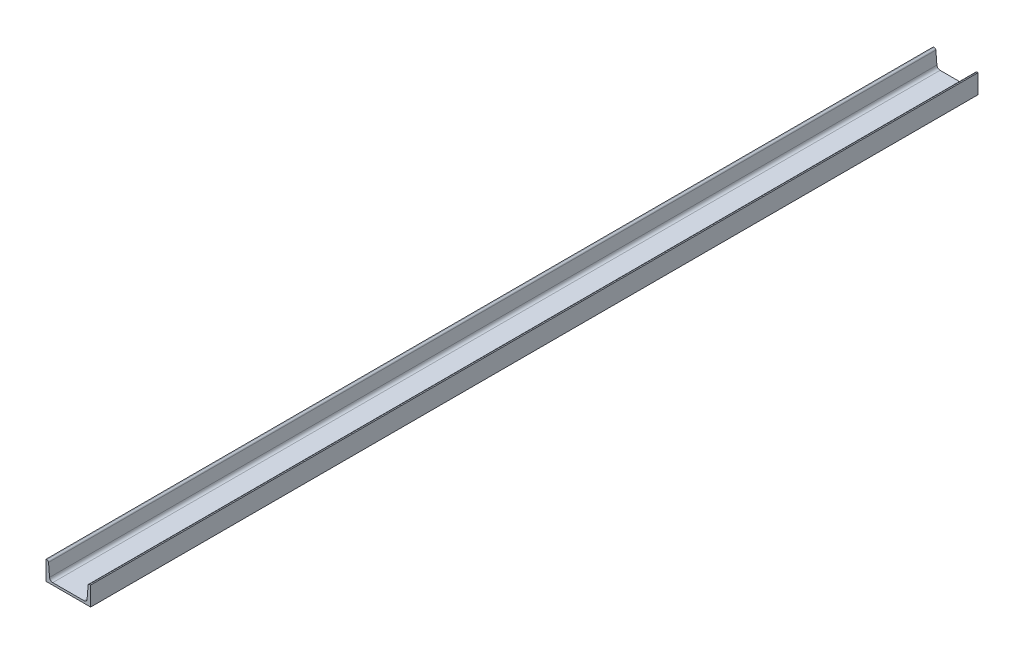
ISO-10303-21;
HEADER;
FILE_DESCRIPTION(('STEP AP214'),'2;1');
FILE_NAME('part.step','',(''),(''),'','','');
FILE_SCHEMA(('AUTOMOTIVE_DESIGN { 1 0 10303 214 1 1 1 1 }'));
ENDSEC;
DATA;
#1=APPLICATION_CONTEXT('core data for automotive mechanical design processes');
#2=APPLICATION_PROTOCOL_DEFINITION('international standard','automotive_design',2000,#1);
#3=PRODUCT_CONTEXT('',#1,'mechanical');
#4=PRODUCT('Part','Part','',(#3));
#5=PRODUCT_RELATED_PRODUCT_CATEGORY('part','',(#4));
#6=PRODUCT_DEFINITION_FORMATION('','',#4);
#7=PRODUCT_DEFINITION_CONTEXT('part definition',#1,'design');
#8=PRODUCT_DEFINITION('design','',#6,#7);
#9=PRODUCT_DEFINITION_SHAPE('','',#8);
#10=(LENGTH_UNIT() NAMED_UNIT(*) SI_UNIT(.MILLI.,.METRE.));
#11=(NAMED_UNIT(*) PLANE_ANGLE_UNIT() SI_UNIT($,.RADIAN.));
#12=(NAMED_UNIT(*) SI_UNIT($,.STERADIAN.) SOLID_ANGLE_UNIT());
#13=UNCERTAINTY_MEASURE_WITH_UNIT(LENGTH_MEASURE(1.E-05),#10,'distance_accuracy_value','');
#14=(GEOMETRIC_REPRESENTATION_CONTEXT(3) GLOBAL_UNCERTAINTY_ASSIGNED_CONTEXT((#13)) GLOBAL_UNIT_ASSIGNED_CONTEXT((#10,
#11,#12)) REPRESENTATION_CONTEXT('',''));
#15=CARTESIAN_POINT('',(0.,0.,0.));
#16=DIRECTION('',(0.,0.,1.));
#17=DIRECTION('',(1.,0.,0.));
#18=AXIS2_PLACEMENT_3D('',#15,#16,#17);
#19=CARTESIAN_POINT('',(48.9280510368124,17.,1391.5));
#20=DIRECTION('',(0.,0.,-1.));
#21=DIRECTION('',(-1.,0.,0.));
#22=AXIS2_PLACEMENT_3D('',#19,#20,#21);
#23=CYLINDRICAL_SURFACE('',#22,10.);
#24=CARTESIAN_POINT('',(48.9280510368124,17.,-1391.5));
#25=DIRECTION('',(0.,0.,1.));
#26=DIRECTION('',(1.,0.,0.));
#27=AXIS2_PLACEMENT_3D('',#24,#25,#26);
#28=CIRCLE('',#27,10.);
#29=CARTESIAN_POINT('',(48.9280510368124,7.,-1391.5));
#30=VERTEX_POINT('',#29);
#31=CARTESIAN_POINT('',(58.8962038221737,16.202547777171,-1391.5));
#32=VERTEX_POINT('',#31);
#33=EDGE_CURVE('E103',#30,#32,#28,.T.);
#34=ORIENTED_EDGE('',*,*,#33,.F.);
#35=DIRECTION('',(0.,0.,-1.));
#36=VECTOR('',#35,1.);
#37=CARTESIAN_POINT('',(48.9280510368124,7.,1391.5));
#38=LINE('',#37,#36);
#39=CARTESIAN_POINT('',(48.9280510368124,7.,1391.5));
#40=VERTEX_POINT('',#39);
#41=EDGE_CURVE('E9',#40,#30,#38,.T.);
#42=ORIENTED_EDGE('',*,*,#41,.F.);
#43=CARTESIAN_POINT('',(48.9280510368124,17.,1391.5));
#44=DIRECTION('',(0.,0.,1.));
#45=DIRECTION('',(1.,0.,0.));
#46=AXIS2_PLACEMENT_3D('',#43,#44,#45);
#47=CIRCLE('',#46,10.);
#48=CARTESIAN_POINT('',(58.8962038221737,16.202547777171,1391.5));
#49=VERTEX_POINT('',#48);
#50=EDGE_CURVE('E105',#40,#49,#47,.T.);
#51=ORIENTED_EDGE('',*,*,#50,.T.);
#52=DIRECTION('',(0.,0.,-1.));
#53=VECTOR('',#52,1.);
#54=CARTESIAN_POINT('',(58.8962038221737,16.202547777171,1391.5));
#55=LINE('',#54,#53);
#56=EDGE_CURVE('E17',#49,#32,#55,.T.);
#57=ORIENTED_EDGE('',*,*,#56,.T.);
#58=EDGE_LOOP('',(#34,#42,#51,#57));
#59=FACE_BOUND('',#58,.T.);
#60=ADVANCED_FACE('F14',(#59),#23,.F.);
#61=CARTESIAN_POINT('',(-48.9280510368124,7.,1391.5));
#62=DIRECTION('',(0.,1.,0.));
#63=DIRECTION('',(0.,0.,1.));
#64=AXIS2_PLACEMENT_3D('',#61,#62,#63);
#65=PLANE('',#64);
#66=DIRECTION('',(1.,0.,0.));
#67=VECTOR('',#66,1.);
#68=CARTESIAN_POINT('',(-48.9280510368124,7.,-1391.5));
#69=LINE('',#68,#67);
#70=CARTESIAN_POINT('',(-48.9280510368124,7.,-1391.5));
#71=VERTEX_POINT('',#70);
#72=EDGE_CURVE('E124',#71,#30,#69,.T.);
#73=ORIENTED_EDGE('',*,*,#72,.F.);
#74=DIRECTION('',(0.,0.,-1.));
#75=VECTOR('',#74,1.);
#76=CARTESIAN_POINT('',(-48.9280510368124,7.,1391.5));
#77=LINE('',#76,#75);
#78=CARTESIAN_POINT('',(-48.9280510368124,7.,1391.5));
#79=VERTEX_POINT('',#78);
#80=EDGE_CURVE('E23',#79,#71,#77,.T.);
#81=ORIENTED_EDGE('',*,*,#80,.F.);
#82=DIRECTION('',(1.,0.,0.));
#83=VECTOR('',#82,1.);
#84=CARTESIAN_POINT('',(-48.9280510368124,7.,1391.5));
#85=LINE('',#84,#83);
#86=EDGE_CURVE('E111',#79,#40,#85,.T.);
#87=ORIENTED_EDGE('',*,*,#86,.T.);
#88=ORIENTED_EDGE('',*,*,#41,.T.);
#89=EDGE_LOOP('',(#73,#81,#87,#88));
#90=FACE_BOUND('',#89,.T.);
#91=ADVANCED_FACE('F315',(#90),#65,.T.);
#92=CARTESIAN_POINT('',(-48.9280510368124,17.,1391.5));
#93=DIRECTION('',(0.,0.,-1.));
#94=DIRECTION('',(-1.,0.,0.));
#95=AXIS2_PLACEMENT_3D('',#92,#93,#94);
#96=CYLINDRICAL_SURFACE('',#95,10.);
#97=CARTESIAN_POINT('',(-48.9280510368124,17.,-1391.5));
#98=DIRECTION('',(0.,0.,1.));
#99=DIRECTION('',(1.,0.,0.));
#100=AXIS2_PLACEMENT_3D('',#97,#98,#99);
#101=CIRCLE('',#100,10.);
#102=CARTESIAN_POINT('',(-58.8962038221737,16.2025477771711,-1391.5));
#103=VERTEX_POINT('',#102);
#104=EDGE_CURVE('E337',#103,#71,#101,.T.);
#105=ORIENTED_EDGE('',*,*,#104,.F.);
#106=DIRECTION('',(0.,0.,-1.));
#107=VECTOR('',#106,1.);
#108=CARTESIAN_POINT('',(-58.8962038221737,16.2025477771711,1391.5));
#109=LINE('',#108,#107);
#110=CARTESIAN_POINT('',(-58.8962038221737,16.2025477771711,1391.5));
#111=VERTEX_POINT('',#110);
#112=EDGE_CURVE('E170',#111,#103,#109,.T.);
#113=ORIENTED_EDGE('',*,*,#112,.F.);
#114=CARTESIAN_POINT('',(-48.9280510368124,17.,1391.5));
#115=DIRECTION('',(0.,0.,1.));
#116=DIRECTION('',(1.,0.,0.));
#117=AXIS2_PLACEMENT_3D('',#114,#115,#116);
#118=CIRCLE('',#117,10.);
#119=EDGE_CURVE('E161',#111,#79,#118,.T.);
#120=ORIENTED_EDGE('',*,*,#119,.T.);
#121=ORIENTED_EDGE('',*,*,#80,.T.);
#122=EDGE_LOOP('',(#105,#113,#120,#121));
#123=FACE_BOUND('',#122,.T.);
#124=ADVANCED_FACE('F306',(#123),#96,.F.);
#125=CARTESIAN_POINT('',(-58.8962038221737,16.2025477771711,1391.5));
#126=DIRECTION('',(-0.996815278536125,-0.07974522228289,0.));
#127=DIRECTION('',(0.07974522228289,-0.996815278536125,0.));
#128=AXIS2_PLACEMENT_3D('',#125,#126,#127);
#129=PLANE('',#128);
#130=DIRECTION('',(-0.07974522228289,0.996815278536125,0.));
#131=VECTOR('',#130,1.);
#132=CARTESIAN_POINT('',(-58.8962038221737,16.2025477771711,-1391.5));
#133=LINE('',#132,#131);
#134=CARTESIAN_POINT('',(-62.0318980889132,55.3987261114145,-1391.5));
#135=VERTEX_POINT('',#134);
#136=EDGE_CURVE('E343',#103,#135,#133,.T.);
#137=ORIENTED_EDGE('',*,*,#136,.T.);
#138=DIRECTION('',(0.,0.,-1.));
#139=VECTOR('',#138,1.);
#140=CARTESIAN_POINT('',(-62.0318980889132,55.3987261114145,1391.5));
#141=LINE('',#140,#139);
#142=CARTESIAN_POINT('',(-62.0318980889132,55.3987261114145,1391.5));
#143=VERTEX_POINT('',#142);
#144=EDGE_CURVE('E173',#143,#135,#141,.T.);
#145=ORIENTED_EDGE('',*,*,#144,.F.);
#146=DIRECTION('',(-0.07974522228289,0.996815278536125,0.));
#147=VECTOR('',#146,1.);
#148=CARTESIAN_POINT('',(-58.8962038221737,16.2025477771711,1391.5));
#149=LINE('',#148,#147);
#150=EDGE_CURVE('E158',#111,#143,#149,.T.);
#151=ORIENTED_EDGE('',*,*,#150,.F.);
#152=ORIENTED_EDGE('',*,*,#112,.T.);
#153=EDGE_LOOP('',(#137,#145,#151,#152));
#154=FACE_BOUND('',#153,.T.);
#155=ADVANCED_FACE('F297',(#154),#129,.F.);
#156=CARTESIAN_POINT('',(-67.0159744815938,55.,1391.5));
#157=DIRECTION('',(0.,0.,-1.));
#158=DIRECTION('',(-1.,0.,0.));
#159=AXIS2_PLACEMENT_3D('',#156,#157,#158);
#160=CYLINDRICAL_SURFACE('',#159,5.);
#161=CARTESIAN_POINT('',(-67.0159744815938,55.,-1391.5));
#162=DIRECTION('',(0.,0.,1.));
#163=DIRECTION('',(1.,0.,0.));
#164=AXIS2_PLACEMENT_3D('',#161,#162,#163);
#165=CIRCLE('',#164,5.);
#166=CARTESIAN_POINT('',(-67.0159744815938,60.,-1391.5));
#167=VERTEX_POINT('',#166);
#168=EDGE_CURVE('E349',#135,#167,#165,.T.);
#169=ORIENTED_EDGE('',*,*,#168,.T.);
#170=DIRECTION('',(0.,0.,-1.));
#171=VECTOR('',#170,1.);
#172=CARTESIAN_POINT('',(-67.0159744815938,60.,1391.5));
#173=LINE('',#172,#171);
#174=CARTESIAN_POINT('',(-67.0159744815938,60.,1391.5));
#175=VERTEX_POINT('',#174);
#176=EDGE_CURVE('E177',#175,#167,#173,.T.);
#177=ORIENTED_EDGE('',*,*,#176,.F.);
#178=CARTESIAN_POINT('',(-67.0159744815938,55.,1391.5));
#179=DIRECTION('',(0.,0.,1.));
#180=DIRECTION('',(1.,0.,0.));
#181=AXIS2_PLACEMENT_3D('',#178,#179,#180);
#182=CIRCLE('',#181,5.);
#183=EDGE_CURVE('E155',#143,#175,#182,.T.);
#184=ORIENTED_EDGE('',*,*,#183,.F.);
#185=ORIENTED_EDGE('',*,*,#144,.T.);
#186=EDGE_LOOP('',(#169,#177,#184,#185));
#187=FACE_BOUND('',#186,.T.);
#188=ADVANCED_FACE('F288',(#187),#160,.T.);
#189=CARTESIAN_POINT('',(-70.,60.,1391.5));
#190=DIRECTION('',(0.,1.,0.));
#191=DIRECTION('',(0.,0.,1.));
#192=AXIS2_PLACEMENT_3D('',#189,#190,#191);
#193=PLANE('',#192);
#194=DIRECTION('',(1.,0.,0.));
#195=VECTOR('',#194,1.);
#196=CARTESIAN_POINT('',(-70.,60.,-1391.5));
#197=LINE('',#196,#195);
#198=CARTESIAN_POINT('',(-70.,60.,-1391.5));
#199=VERTEX_POINT('',#198);
#200=EDGE_CURVE('E357',#199,#167,#197,.T.);
#201=ORIENTED_EDGE('',*,*,#200,.F.);
#202=DIRECTION('',(0.,0.,-1.));
#203=VECTOR('',#202,1.);
#204=CARTESIAN_POINT('',(-70.,60.,1391.5));
#205=LINE('',#204,#203);
#206=CARTESIAN_POINT('',(-70.,60.,1391.5));
#207=VERTEX_POINT('',#206);
#208=EDGE_CURVE('E180',#207,#199,#205,.T.);
#209=ORIENTED_EDGE('',*,*,#208,.F.);
#210=DIRECTION('',(1.,0.,0.));
#211=VECTOR('',#210,1.);
#212=CARTESIAN_POINT('',(-70.,60.,1391.5));
#213=LINE('',#212,#211);
#214=EDGE_CURVE('E151',#207,#175,#213,.T.);
#215=ORIENTED_EDGE('',*,*,#214,.T.);
#216=ORIENTED_EDGE('',*,*,#176,.T.);
#217=EDGE_LOOP('',(#201,#209,#215,#216));
#218=FACE_BOUND('',#217,.T.);
#219=ADVANCED_FACE('F279',(#218),#193,.T.);
#220=CARTESIAN_POINT('',(-70.,60.,1391.5));
#221=DIRECTION('',(1.,0.,0.));
#222=DIRECTION('',(0.,0.,-1.));
#223=AXIS2_PLACEMENT_3D('',#220,#221,#222);
#224=PLANE('',#223);
#225=DIRECTION('',(0.,-1.,0.));
#226=VECTOR('',#225,1.);
#227=CARTESIAN_POINT('',(-70.,60.,-1391.5));
#228=LINE('',#227,#226);
#229=CARTESIAN_POINT('',(-70.,0.,-1391.5));
#230=VERTEX_POINT('',#229);
#231=EDGE_CURVE('E365',#199,#230,#228,.T.);
#232=ORIENTED_EDGE('',*,*,#231,.T.);
#233=DIRECTION('',(0.,0.,-1.));
#234=VECTOR('',#233,1.);
#235=CARTESIAN_POINT('',(-70.,0.,1391.5));
#236=LINE('',#235,#234);
#237=CARTESIAN_POINT('',(-70.,0.,1391.5));
#238=VERTEX_POINT('',#237);
#239=EDGE_CURVE('E183',#238,#230,#236,.T.);
#240=ORIENTED_EDGE('',*,*,#239,.F.);
#241=DIRECTION('',(0.,-1.,0.));
#242=VECTOR('',#241,1.);
#243=CARTESIAN_POINT('',(-70.,60.,1391.5));
#244=LINE('',#243,#242);
#245=EDGE_CURVE('E148',#207,#238,#244,.T.);
#246=ORIENTED_EDGE('',*,*,#245,.F.);
#247=ORIENTED_EDGE('',*,*,#208,.T.);
#248=EDGE_LOOP('',(#232,#240,#246,#247));
#249=FACE_BOUND('',#248,.T.);
#250=ADVANCED_FACE('F270',(#249),#224,.F.);
#251=CARTESIAN_POINT('',(-70.,0.,1391.5));
#252=DIRECTION('',(0.,1.,0.));
#253=DIRECTION('',(0.,0.,1.));
#254=AXIS2_PLACEMENT_3D('',#251,#252,#253);
#255=PLANE('',#254);
#256=DIRECTION('',(1.,0.,0.));
#257=VECTOR('',#256,1.);
#258=CARTESIAN_POINT('',(-70.,0.,-1391.5));
#259=LINE('',#258,#257);
#260=CARTESIAN_POINT('',(70.,0.,-1391.5));
#261=VERTEX_POINT('',#260);
#262=EDGE_CURVE('E372',#230,#261,#259,.T.);
#263=ORIENTED_EDGE('',*,*,#262,.T.);
#264=DIRECTION('',(0.,0.,-1.));
#265=VECTOR('',#264,1.);
#266=CARTESIAN_POINT('',(70.,0.,1391.5));
#267=LINE('',#266,#265);
#268=CARTESIAN_POINT('',(70.,0.,1391.5));
#269=VERTEX_POINT('',#268);
#270=EDGE_CURVE('E187',#269,#261,#267,.T.);
#271=ORIENTED_EDGE('',*,*,#270,.F.);
#272=DIRECTION('',(1.,0.,0.));
#273=VECTOR('',#272,1.);
#274=CARTESIAN_POINT('',(-70.,0.,1391.5));
#275=LINE('',#274,#273);
#276=EDGE_CURVE('E145',#238,#269,#275,.T.);
#277=ORIENTED_EDGE('',*,*,#276,.F.);
#278=ORIENTED_EDGE('',*,*,#239,.T.);
#279=EDGE_LOOP('',(#263,#271,#277,#278));
#280=FACE_BOUND('',#279,.T.);
#281=ADVANCED_FACE('F261',(#280),#255,.F.);
#282=CARTESIAN_POINT('',(70.,0.,1391.5));
#283=DIRECTION('',(-1.,0.,0.));
#284=DIRECTION('',(0.,0.,1.));
#285=AXIS2_PLACEMENT_3D('',#282,#283,#284);
#286=PLANE('',#285);
#287=DIRECTION('',(0.,1.,0.));
#288=VECTOR('',#287,1.);
#289=CARTESIAN_POINT('',(70.,0.,-1391.5));
#290=LINE('',#289,#288);
#291=CARTESIAN_POINT('',(70.,60.,-1391.5));
#292=VERTEX_POINT('',#291);
#293=EDGE_CURVE('E379',#261,#292,#290,.T.);
#294=ORIENTED_EDGE('',*,*,#293,.T.);
#295=DIRECTION('',(0.,0.,-1.));
#296=VECTOR('',#295,1.);
#297=CARTESIAN_POINT('',(70.,60.,1391.5));
#298=LINE('',#297,#296);
#299=CARTESIAN_POINT('',(70.,60.,1391.5));
#300=VERTEX_POINT('',#299);
#301=EDGE_CURVE('E191',#300,#292,#298,.T.);
#302=ORIENTED_EDGE('',*,*,#301,.F.);
#303=DIRECTION('',(0.,1.,0.));
#304=VECTOR('',#303,1.);
#305=CARTESIAN_POINT('',(70.,0.,1391.5));
#306=LINE('',#305,#304);
#307=EDGE_CURVE('E142',#269,#300,#306,.T.);
#308=ORIENTED_EDGE('',*,*,#307,.F.);
#309=ORIENTED_EDGE('',*,*,#270,.T.);
#310=EDGE_LOOP('',(#294,#302,#308,#309));
#311=FACE_BOUND('',#310,.T.);
#312=ADVANCED_FACE('F252',(#311),#286,.F.);
#313=CARTESIAN_POINT('',(70.,60.,1391.5));
#314=DIRECTION('',(0.,-1.,0.));
#315=DIRECTION('',(0.,0.,-1.));
#316=AXIS2_PLACEMENT_3D('',#313,#314,#315);
#317=PLANE('',#316);
#318=DIRECTION('',(-1.,0.,0.));
#319=VECTOR('',#318,1.);
#320=CARTESIAN_POINT('',(70.,60.,-1391.5));
#321=LINE('',#320,#319);
#322=CARTESIAN_POINT('',(67.0159744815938,60.,-1391.5));
#323=VERTEX_POINT('',#322);
#324=EDGE_CURVE('E386',#292,#323,#321,.T.);
#325=ORIENTED_EDGE('',*,*,#324,.T.);
#326=DIRECTION('',(0.,0.,-1.));
#327=VECTOR('',#326,1.);
#328=CARTESIAN_POINT('',(67.0159744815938,60.,1391.5));
#329=LINE('',#328,#327);
#330=CARTESIAN_POINT('',(67.0159744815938,60.,1391.5));
#331=VERTEX_POINT('',#330);
#332=EDGE_CURVE('E195',#331,#323,#329,.T.);
#333=ORIENTED_EDGE('',*,*,#332,.F.);
#334=DIRECTION('',(-1.,0.,0.));
#335=VECTOR('',#334,1.);
#336=CARTESIAN_POINT('',(70.,60.,1391.5));
#337=LINE('',#336,#335);
#338=EDGE_CURVE('E139',#300,#331,#337,.T.);
#339=ORIENTED_EDGE('',*,*,#338,.F.);
#340=ORIENTED_EDGE('',*,*,#301,.T.);
#341=EDGE_LOOP('',(#325,#333,#339,#340));
#342=FACE_BOUND('',#341,.T.);
#343=ADVANCED_FACE('F244',(#342),#317,.F.);
#344=CARTESIAN_POINT('',(67.0159744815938,55.,1391.5));
#345=DIRECTION('',(0.,0.,-1.));
#346=DIRECTION('',(-1.,0.,0.));
#347=AXIS2_PLACEMENT_3D('',#344,#345,#346);
#348=CYLINDRICAL_SURFACE('',#347,5.);
#349=CARTESIAN_POINT('',(67.0159744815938,55.,-1391.5));
#350=DIRECTION('',(0.,0.,1.));
#351=DIRECTION('',(1.,0.,0.));
#352=AXIS2_PLACEMENT_3D('',#349,#350,#351);
#353=CIRCLE('',#352,5.);
#354=CARTESIAN_POINT('',(62.0318980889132,55.3987261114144,-1391.5));
#355=VERTEX_POINT('',#354);
#356=EDGE_CURVE('E120',#323,#355,#353,.T.);
#357=ORIENTED_EDGE('',*,*,#356,.T.);
#358=DIRECTION('',(0.,0.,-1.));
#359=VECTOR('',#358,1.);
#360=CARTESIAN_POINT('',(62.0318980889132,55.3987261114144,1391.5));
#361=LINE('',#360,#359);
#362=CARTESIAN_POINT('',(62.0318980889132,55.3987261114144,1391.5));
#363=VERTEX_POINT('',#362);
#364=EDGE_CURVE('E110',#363,#355,#361,.T.);
#365=ORIENTED_EDGE('',*,*,#364,.F.);
#366=CARTESIAN_POINT('',(67.0159744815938,55.,1391.5));
#367=DIRECTION('',(0.,0.,1.));
#368=DIRECTION('',(1.,0.,0.));
#369=AXIS2_PLACEMENT_3D('',#366,#367,#368);
#370=CIRCLE('',#369,5.);
#371=EDGE_CURVE('E136',#331,#363,#370,.T.);
#372=ORIENTED_EDGE('',*,*,#371,.F.);
#373=ORIENTED_EDGE('',*,*,#332,.T.);
#374=EDGE_LOOP('',(#357,#365,#372,#373));
#375=FACE_BOUND('',#374,.T.);
#376=ADVANCED_FACE('F211',(#375),#348,.T.);
#377=CARTESIAN_POINT('',(58.8962038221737,16.202547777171,1391.5));
#378=DIRECTION('',(-0.996815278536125,0.0797452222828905,0.));
#379=DIRECTION('',(-0.0797452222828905,-0.996815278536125,0.));
#380=AXIS2_PLACEMENT_3D('',#377,#378,#379);
#381=PLANE('',#380);
#382=DIRECTION('',(0.0797452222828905,0.996815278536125,0.));
#383=VECTOR('',#382,1.);
#384=CARTESIAN_POINT('',(58.8962038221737,16.202547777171,-1391.5));
#385=LINE('',#384,#383);
#386=EDGE_CURVE('E113',#32,#355,#385,.T.);
#387=ORIENTED_EDGE('',*,*,#386,.F.);
#388=ORIENTED_EDGE('',*,*,#56,.F.);
#389=DIRECTION('',(0.0797452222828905,0.996815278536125,0.));
#390=VECTOR('',#389,1.);
#391=CARTESIAN_POINT('',(58.8962038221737,16.202547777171,1391.5));
#392=LINE('',#391,#390);
#393=EDGE_CURVE('E133',#49,#363,#392,.T.);
#394=ORIENTED_EDGE('',*,*,#393,.T.);
#395=ORIENTED_EDGE('',*,*,#364,.T.);
#396=EDGE_LOOP('',(#387,#388,#394,#395));
#397=FACE_BOUND('',#396,.T.);
#398=ADVANCED_FACE('F114',(#397),#381,.T.);
#399=CARTESIAN_POINT('',(48.9280510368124,17.,1391.5));
#400=DIRECTION('',(0.,0.,1.));
#401=DIRECTION('',(1.,0.,0.));
#402=AXIS2_PLACEMENT_3D('',#399,#400,#401);
#403=PLANE('',#402);
#404=ORIENTED_EDGE('',*,*,#50,.F.);
#405=ORIENTED_EDGE('',*,*,#86,.F.);
#406=ORIENTED_EDGE('',*,*,#119,.F.);
#407=ORIENTED_EDGE('',*,*,#150,.T.);
#408=ORIENTED_EDGE('',*,*,#183,.T.);
#409=ORIENTED_EDGE('',*,*,#214,.F.);
#410=ORIENTED_EDGE('',*,*,#245,.T.);
#411=ORIENTED_EDGE('',*,*,#276,.T.);
#412=ORIENTED_EDGE('',*,*,#307,.T.);
#413=ORIENTED_EDGE('',*,*,#338,.T.);
#414=ORIENTED_EDGE('',*,*,#371,.T.);
#415=ORIENTED_EDGE('',*,*,#393,.F.);
#416=EDGE_LOOP('',(#404,#405,#406,#407,#408,#409,#410,#411,#412,#413,#414,#415));
#417=FACE_BOUND('',#416,.T.);
#418=ADVANCED_FACE('F210',(#417),#403,.T.);
#419=CARTESIAN_POINT('',(48.9280510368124,17.,-1391.5));
#420=DIRECTION('',(0.,0.,1.));
#421=DIRECTION('',(1.,0.,0.));
#422=AXIS2_PLACEMENT_3D('',#419,#420,#421);
#423=PLANE('',#422);
#424=ORIENTED_EDGE('',*,*,#33,.T.);
#425=ORIENTED_EDGE('',*,*,#386,.T.);
#426=ORIENTED_EDGE('',*,*,#356,.F.);
#427=ORIENTED_EDGE('',*,*,#324,.F.);
#428=ORIENTED_EDGE('',*,*,#293,.F.);
#429=ORIENTED_EDGE('',*,*,#262,.F.);
#430=ORIENTED_EDGE('',*,*,#231,.F.);
#431=ORIENTED_EDGE('',*,*,#200,.T.);
#432=ORIENTED_EDGE('',*,*,#168,.F.);
#433=ORIENTED_EDGE('',*,*,#136,.F.);
#434=ORIENTED_EDGE('',*,*,#104,.T.);
#435=ORIENTED_EDGE('',*,*,#72,.T.);
#436=EDGE_LOOP('',(#424,#425,#426,#427,#428,#429,#430,#431,#432,#433,#434,#435));
#437=FACE_BOUND('',#436,.T.);
#438=ADVANCED_FACE('F122',(#437),#423,.F.);
#439=CLOSED_SHELL('',(#60,#91,#124,#155,#188,#219,#250,#281,#312,#343,#376,#398,#418,#438));
#440=MANIFOLD_SOLID_BREP('B1',#439);
#441=ADVANCED_BREP_SHAPE_REPRESENTATION('',(#18,#440),#14);
#442=SHAPE_DEFINITION_REPRESENTATION(#9,#441);
ENDSEC;
END-ISO-10303-21;
